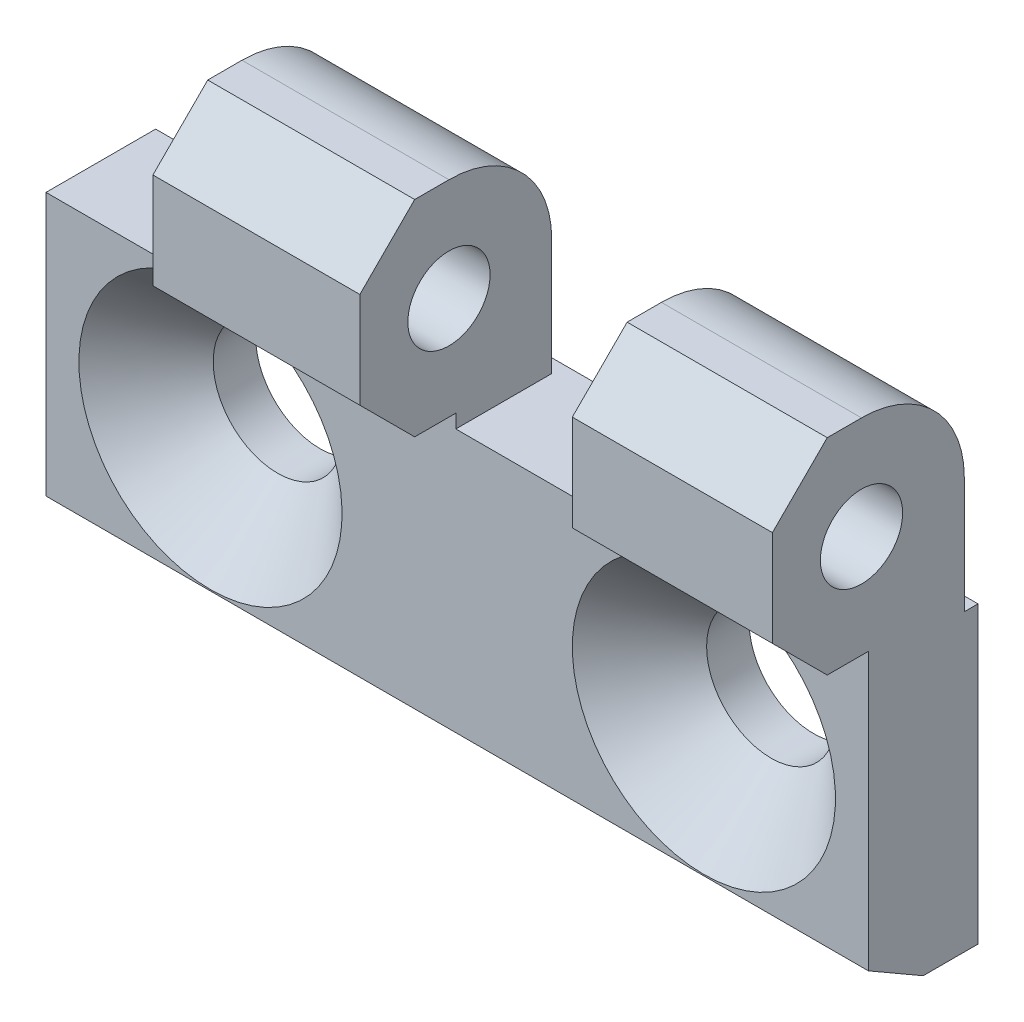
ISO-10303-21;
HEADER;
FILE_DESCRIPTION(('STEP AP214'),'2;1');
FILE_NAME('part.step','',(''),(''),'','','');
FILE_SCHEMA(('AUTOMOTIVE_DESIGN { 1 0 10303 214 1 1 1 1 }'));
ENDSEC;
DATA;
#1=APPLICATION_CONTEXT('core data for automotive mechanical design processes');
#2=APPLICATION_PROTOCOL_DEFINITION('international standard','automotive_design',2000,#1);
#3=PRODUCT_CONTEXT('',#1,'mechanical');
#4=PRODUCT('Part','Part','',(#3));
#5=PRODUCT_RELATED_PRODUCT_CATEGORY('part','',(#4));
#6=PRODUCT_DEFINITION_FORMATION('','',#4);
#7=PRODUCT_DEFINITION_CONTEXT('part definition',#1,'design');
#8=PRODUCT_DEFINITION('design','',#6,#7);
#9=PRODUCT_DEFINITION_SHAPE('','',#8);
#10=(LENGTH_UNIT() NAMED_UNIT(*) SI_UNIT(.MILLI.,.METRE.));
#11=(NAMED_UNIT(*) PLANE_ANGLE_UNIT() SI_UNIT($,.RADIAN.));
#12=(NAMED_UNIT(*) SI_UNIT($,.STERADIAN.) SOLID_ANGLE_UNIT());
#13=UNCERTAINTY_MEASURE_WITH_UNIT(LENGTH_MEASURE(1.E-05),#10,'distance_accuracy_value','');
#14=(GEOMETRIC_REPRESENTATION_CONTEXT(3) GLOBAL_UNCERTAINTY_ASSIGNED_CONTEXT((#13)) GLOBAL_UNIT_ASSIGNED_CONTEXT((#10,
#11,#12)) REPRESENTATION_CONTEXT('',''));
#15=CARTESIAN_POINT('',(0.,0.,0.));
#16=DIRECTION('',(0.,0.,1.));
#17=DIRECTION('',(1.,0.,0.));
#18=AXIS2_PLACEMENT_3D('',#15,#16,#17);
#19=CARTESIAN_POINT('',(-6.,12.75,0.5));
#20=DIRECTION('',(0.,1.,0.));
#21=DIRECTION('',(0.,0.,1.));
#22=AXIS2_PLACEMENT_3D('',#19,#20,#21);
#23=PLANE('',#22);
#24=DIRECTION('',(0.,0.,1.));
#25=VECTOR('',#24,1.);
#26=CARTESIAN_POINT('',(8.95,12.75,0.5));
#27=LINE('',#26,#25);
#28=CARTESIAN_POINT('',(8.95,12.75,5.5));
#29=VERTEX_POINT('',#28);
#30=CARTESIAN_POINT('',(8.95,12.75,4.25));
#31=VERTEX_POINT('',#30);
#32=EDGE_CURVE('E290',#29,#31,#27,.F.);
#33=ORIENTED_EDGE('',*,*,#32,.T.);
#34=DIRECTION('',(-1.,0.,0.));
#35=VECTOR('',#34,1.);
#36=CARTESIAN_POINT('',(24.05658667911,12.75,4.25));
#37=LINE('',#36,#35);
#38=CARTESIAN_POINT('',(1.4,12.75,4.25));
#39=VERTEX_POINT('',#38);
#40=EDGE_CURVE('E287',#39,#31,#37,.F.);
#41=ORIENTED_EDGE('',*,*,#40,.F.);
#42=DIRECTION('',(0.,0.,1.));
#43=VECTOR('',#42,1.);
#44=CARTESIAN_POINT('',(1.4,12.75,0.5));
#45=LINE('',#44,#43);
#46=CARTESIAN_POINT('',(1.4,12.75,5.5));
#47=VERTEX_POINT('',#46);
#48=EDGE_CURVE('E175',#39,#47,#45,.T.);
#49=ORIENTED_EDGE('',*,*,#48,.T.);
#50=DIRECTION('',(1.,0.,0.));
#51=VECTOR('',#50,1.);
#52=CARTESIAN_POINT('',(-6.,12.75,5.5));
#53=LINE('',#52,#51);
#54=EDGE_CURVE('E254',#29,#47,#53,.F.);
#55=ORIENTED_EDGE('',*,*,#54,.F.);
#56=EDGE_LOOP('',(#33,#41,#49,#55));
#57=FACE_BOUND('',#56,.T.);
#58=ADVANCED_FACE('F14',(#57),#23,.T.);
#59=CARTESIAN_POINT('',(24.05658667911,9.,4.25));
#60=DIRECTION('',(-1.,0.,0.));
#61=DIRECTION('',(0.,0.,-1.));
#62=AXIS2_PLACEMENT_3D('',#59,#60,#61);
#63=CYLINDRICAL_SURFACE('',#62,3.75);
#64=CARTESIAN_POINT('',(8.95,9.,4.25));
#65=DIRECTION('',(-1.,0.,0.));
#66=DIRECTION('',(0.,0.,-1.));
#67=AXIS2_PLACEMENT_3D('',#64,#65,#66);
#68=CIRCLE('',#67,3.75);
#69=CARTESIAN_POINT('',(8.95,9.,0.5));
#70=VERTEX_POINT('',#69);
#71=EDGE_CURVE('E185',#31,#70,#68,.T.);
#72=ORIENTED_EDGE('',*,*,#71,.T.);
#73=DIRECTION('',(1.,0.,0.));
#74=VECTOR('',#73,1.);
#75=CARTESIAN_POINT('',(-6.,9.,0.5));
#76=LINE('',#75,#74);
#77=CARTESIAN_POINT('',(1.4,9.,0.5));
#78=VERTEX_POINT('',#77);
#79=EDGE_CURVE('E182',#78,#70,#76,.T.);
#80=ORIENTED_EDGE('',*,*,#79,.F.);
#81=CARTESIAN_POINT('',(1.4,9.,4.25));
#82=DIRECTION('',(-1.,0.,0.));
#83=DIRECTION('',(0.,0.,-1.));
#84=AXIS2_PLACEMENT_3D('',#81,#82,#83);
#85=CIRCLE('',#84,3.75);
#86=EDGE_CURVE('E17',#78,#39,#85,.F.);
#87=ORIENTED_EDGE('',*,*,#86,.T.);
#88=ORIENTED_EDGE('',*,*,#40,.T.);
#89=EDGE_LOOP('',(#72,#80,#87,#88));
#90=FACE_BOUND('',#89,.T.);
#91=ADVANCED_FACE('F183',(#90),#63,.T.);
#92=CARTESIAN_POINT('',(-6.,5.25,5.5));
#93=DIRECTION('',(0.,-0.707106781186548,0.707106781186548));
#94=DIRECTION('',(0.,-0.707106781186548,-0.707106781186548));
#95=AXIS2_PLACEMENT_3D('',#92,#93,#94);
#96=PLANE('',#95);
#97=DIRECTION('',(1.,0.,0.));
#98=VECTOR('',#97,1.);
#99=CARTESIAN_POINT('',(-6.,7.25,7.5));
#100=LINE('',#99,#98);
#101=CARTESIAN_POINT('',(1.4,7.25,7.5));
#102=VERTEX_POINT('',#101);
#103=CARTESIAN_POINT('',(8.95,7.25,7.5));
#104=VERTEX_POINT('',#103);
#105=EDGE_CURVE('E289',#102,#104,#100,.T.);
#106=ORIENTED_EDGE('',*,*,#105,.F.);
#107=DIRECTION('',(0.,-0.707106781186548,-0.707106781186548));
#108=VECTOR('',#107,1.);
#109=CARTESIAN_POINT('',(1.4,7.25,7.5));
#110=LINE('',#109,#108);
#111=CARTESIAN_POINT('',(1.4,5.25,5.5));
#112=VERTEX_POINT('',#111);
#113=EDGE_CURVE('E195',#102,#112,#110,.T.);
#114=ORIENTED_EDGE('',*,*,#113,.T.);
#115=DIRECTION('',(1.,0.,0.));
#116=VECTOR('',#115,1.);
#117=CARTESIAN_POINT('',(-6.,5.25,5.5));
#118=LINE('',#117,#116);
#119=CARTESIAN_POINT('',(8.95,5.25,5.5));
#120=VERTEX_POINT('',#119);
#121=EDGE_CURVE('E180',#120,#112,#118,.F.);
#122=ORIENTED_EDGE('',*,*,#121,.F.);
#123=DIRECTION('',(0.,0.707106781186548,0.707106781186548));
#124=VECTOR('',#123,1.);
#125=CARTESIAN_POINT('',(8.95,5.25,5.5));
#126=LINE('',#125,#124);
#127=EDGE_CURVE('E224',#120,#104,#126,.T.);
#128=ORIENTED_EDGE('',*,*,#127,.T.);
#129=EDGE_LOOP('',(#106,#114,#122,#128));
#130=FACE_BOUND('',#129,.T.);
#131=ADVANCED_FACE('F543',(#130),#96,.T.);
#132=CARTESIAN_POINT('',(-6.,12.75,7.5));
#133=DIRECTION('',(0.,0.,1.));
#134=DIRECTION('',(0.,-1.,0.));
#135=AXIS2_PLACEMENT_3D('',#132,#133,#134);
#136=PLANE('',#135);
#137=DIRECTION('',(1.,0.,0.));
#138=VECTOR('',#137,1.);
#139=CARTESIAN_POINT('',(-6.,10.75,7.5));
#140=LINE('',#139,#138);
#141=CARTESIAN_POINT('',(1.4,10.75,7.5));
#142=VERTEX_POINT('',#141);
#143=CARTESIAN_POINT('',(8.95,10.75,7.5));
#144=VERTEX_POINT('',#143);
#145=EDGE_CURVE('E301',#142,#144,#140,.T.);
#146=ORIENTED_EDGE('',*,*,#145,.F.);
#147=DIRECTION('',(0.,-1.,0.));
#148=VECTOR('',#147,1.);
#149=CARTESIAN_POINT('',(1.4,4.75,7.5));
#150=LINE('',#149,#148);
#151=EDGE_CURVE('E292',#142,#102,#150,.T.);
#152=ORIENTED_EDGE('',*,*,#151,.T.);
#153=ORIENTED_EDGE('',*,*,#105,.T.);
#154=DIRECTION('',(0.,-1.,0.));
#155=VECTOR('',#154,1.);
#156=CARTESIAN_POINT('',(8.95,12.75,7.5));
#157=LINE('',#156,#155);
#158=EDGE_CURVE('E284',#104,#144,#157,.F.);
#159=ORIENTED_EDGE('',*,*,#158,.T.);
#160=EDGE_LOOP('',(#146,#152,#153,#159));
#161=FACE_BOUND('',#160,.T.);
#162=ADVANCED_FACE('F546',(#161),#136,.T.);
#163=CARTESIAN_POINT('',(-6.,10.75,7.5));
#164=DIRECTION('',(0.,0.707106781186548,0.707106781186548));
#165=DIRECTION('',(0.,-0.707106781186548,0.707106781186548));
#166=AXIS2_PLACEMENT_3D('',#163,#164,#165);
#167=PLANE('',#166);
#168=ORIENTED_EDGE('',*,*,#54,.T.);
#169=DIRECTION('',(0.,-0.707106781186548,0.707106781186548));
#170=VECTOR('',#169,1.);
#171=CARTESIAN_POINT('',(1.4,12.75,5.5));
#172=LINE('',#171,#170);
#173=EDGE_CURVE('E179',#47,#142,#172,.T.);
#174=ORIENTED_EDGE('',*,*,#173,.T.);
#175=ORIENTED_EDGE('',*,*,#145,.T.);
#176=DIRECTION('',(0.,0.707106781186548,-0.707106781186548));
#177=VECTOR('',#176,1.);
#178=CARTESIAN_POINT('',(8.95,10.75,7.5));
#179=LINE('',#178,#177);
#180=EDGE_CURVE('E334',#144,#29,#179,.T.);
#181=ORIENTED_EDGE('',*,*,#180,.T.);
#182=EDGE_LOOP('',(#168,#174,#175,#181));
#183=FACE_BOUND('',#182,.T.);
#184=ADVANCED_FACE('F550',(#183),#167,.T.);
#185=CARTESIAN_POINT('',(-6.,12.75,0.5));
#186=DIRECTION('',(0.,1.,0.));
#187=DIRECTION('',(0.,0.,1.));
#188=AXIS2_PLACEMENT_3D('',#185,#186,#187);
#189=PLANE('',#188);
#190=DIRECTION('',(0.,0.,1.));
#191=VECTOR('',#190,1.);
#192=CARTESIAN_POINT('',(24.,12.75,0.5));
#193=LINE('',#192,#191);
#194=CARTESIAN_POINT('',(24.,12.75,5.5));
#195=VERTEX_POINT('',#194);
#196=CARTESIAN_POINT('',(24.,12.75,4.25));
#197=VERTEX_POINT('',#196);
#198=EDGE_CURVE('E243',#195,#197,#193,.F.);
#199=ORIENTED_EDGE('',*,*,#198,.T.);
#200=DIRECTION('',(-1.,0.,0.));
#201=VECTOR('',#200,1.);
#202=CARTESIAN_POINT('',(24.05658667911,12.75,4.25));
#203=LINE('',#202,#201);
#204=CARTESIAN_POINT('',(16.7,12.75,4.25));
#205=VERTEX_POINT('',#204);
#206=EDGE_CURVE('E465',#205,#197,#203,.F.);
#207=ORIENTED_EDGE('',*,*,#206,.F.);
#208=DIRECTION('',(0.,0.,1.));
#209=VECTOR('',#208,1.);
#210=CARTESIAN_POINT('',(16.7,12.75,8.25));
#211=LINE('',#210,#209);
#212=CARTESIAN_POINT('',(16.7,12.75,5.5));
#213=VERTEX_POINT('',#212);
#214=EDGE_CURVE('E231',#205,#213,#211,.T.);
#215=ORIENTED_EDGE('',*,*,#214,.T.);
#216=DIRECTION('',(1.,0.,0.));
#217=VECTOR('',#216,1.);
#218=CARTESIAN_POINT('',(-6.,12.75,5.5));
#219=LINE('',#218,#217);
#220=EDGE_CURVE('E230',#195,#213,#219,.F.);
#221=ORIENTED_EDGE('',*,*,#220,.F.);
#222=EDGE_LOOP('',(#199,#207,#215,#221));
#223=FACE_BOUND('',#222,.T.);
#224=ADVANCED_FACE('F604',(#223),#189,.T.);
#225=CARTESIAN_POINT('',(-6.,5.25,7.5));
#226=DIRECTION('',(0.,-1.,0.));
#227=DIRECTION('',(0.,0.,-1.));
#228=AXIS2_PLACEMENT_3D('',#225,#226,#227);
#229=PLANE('',#228);
#230=DIRECTION('',(1.,0.,0.));
#231=VECTOR('',#230,1.);
#232=CARTESIAN_POINT('',(-6.,5.25,5.5));
#233=LINE('',#232,#231);
#234=CARTESIAN_POINT('',(16.7,5.25,5.5));
#235=VERTEX_POINT('',#234);
#236=CARTESIAN_POINT('',(24.,5.25,5.5));
#237=VERTEX_POINT('',#236);
#238=EDGE_CURVE('E257',#235,#237,#233,.T.);
#239=ORIENTED_EDGE('',*,*,#238,.F.);
#240=DIRECTION('',(0.,0.,1.));
#241=VECTOR('',#240,1.);
#242=CARTESIAN_POINT('',(16.7,5.25,8.25));
#243=LINE('',#242,#241);
#244=CARTESIAN_POINT('',(16.7,5.25,4.));
#245=VERTEX_POINT('',#244);
#246=EDGE_CURVE('E228',#235,#245,#243,.F.);
#247=ORIENTED_EDGE('',*,*,#246,.T.);
#248=DIRECTION('',(1.,0.,0.));
#249=VECTOR('',#248,1.);
#250=CARTESIAN_POINT('',(-6.,5.25,4.));
#251=LINE('',#250,#249);
#252=CARTESIAN_POINT('',(24.,5.25,4.));
#253=VERTEX_POINT('',#252);
#254=EDGE_CURVE('E234',#253,#245,#251,.F.);
#255=ORIENTED_EDGE('',*,*,#254,.F.);
#256=DIRECTION('',(0.,0.,-1.));
#257=VECTOR('',#256,1.);
#258=CARTESIAN_POINT('',(24.,5.25,7.5));
#259=LINE('',#258,#257);
#260=EDGE_CURVE('E241',#253,#237,#259,.F.);
#261=ORIENTED_EDGE('',*,*,#260,.T.);
#262=EDGE_LOOP('',(#239,#247,#255,#261));
#263=FACE_BOUND('',#262,.T.);
#264=ADVANCED_FACE('F601',(#263),#229,.T.);
#265=CARTESIAN_POINT('',(-6.,5.25,7.5));
#266=DIRECTION('',(0.,-1.,0.));
#267=DIRECTION('',(0.,0.,-1.));
#268=AXIS2_PLACEMENT_3D('',#265,#266,#267);
#269=PLANE('',#268);
#270=ORIENTED_EDGE('',*,*,#121,.T.);
#271=DIRECTION('',(0.,0.,1.));
#272=VECTOR('',#271,1.);
#273=CARTESIAN_POINT('',(1.4,5.25,8.25));
#274=LINE('',#273,#272);
#275=CARTESIAN_POINT('',(1.4,5.25,4.));
#276=VERTEX_POINT('',#275);
#277=EDGE_CURVE('E193',#112,#276,#274,.F.);
#278=ORIENTED_EDGE('',*,*,#277,.T.);
#279=DIRECTION('',(1.,0.,0.));
#280=VECTOR('',#279,1.);
#281=CARTESIAN_POINT('',(-6.,5.25,4.));
#282=LINE('',#281,#280);
#283=CARTESIAN_POINT('',(8.95,5.25,4.));
#284=VERTEX_POINT('',#283);
#285=EDGE_CURVE('E211',#284,#276,#282,.F.);
#286=ORIENTED_EDGE('',*,*,#285,.F.);
#287=DIRECTION('',(0.,0.,-1.));
#288=VECTOR('',#287,1.);
#289=CARTESIAN_POINT('',(8.95,5.25,8.25));
#290=LINE('',#289,#288);
#291=EDGE_CURVE('E221',#284,#120,#290,.F.);
#292=ORIENTED_EDGE('',*,*,#291,.T.);
#293=EDGE_LOOP('',(#270,#278,#286,#292));
#294=FACE_BOUND('',#293,.T.);
#295=ADVANCED_FACE('F540',(#294),#269,.T.);
#296=CARTESIAN_POINT('',(1.4,4.75,8.25));
#297=DIRECTION('',(1.,0.,0.));
#298=DIRECTION('',(0.,0.,1.));
#299=AXIS2_PLACEMENT_3D('',#296,#297,#298);
#300=PLANE('',#299);
#301=DIRECTION('',(0.,0.,1.));
#302=VECTOR('',#301,1.);
#303=CARTESIAN_POINT('',(1.4,4.75,0.));
#304=LINE('',#303,#302);
#305=CARTESIAN_POINT('',(1.4,4.75,4.));
#306=VERTEX_POINT('',#305);
#307=CARTESIAN_POINT('',(1.4,4.75,0.5));
#308=VERTEX_POINT('',#307);
#309=EDGE_CURVE('E203',#306,#308,#304,.F.);
#310=ORIENTED_EDGE('',*,*,#309,.F.);
#311=DIRECTION('',(0.,-1.,0.));
#312=VECTOR('',#311,1.);
#313=CARTESIAN_POINT('',(1.4,5.25,4.));
#314=LINE('',#313,#312);
#315=EDGE_CURVE('E208',#276,#306,#314,.T.);
#316=ORIENTED_EDGE('',*,*,#315,.F.);
#317=ORIENTED_EDGE('',*,*,#277,.F.);
#318=ORIENTED_EDGE('',*,*,#113,.F.);
#319=ORIENTED_EDGE('',*,*,#151,.F.);
#320=ORIENTED_EDGE('',*,*,#173,.F.);
#321=ORIENTED_EDGE('',*,*,#48,.F.);
#322=ORIENTED_EDGE('',*,*,#86,.F.);
#323=DIRECTION('',(0.,1.,0.));
#324=VECTOR('',#323,1.);
#325=CARTESIAN_POINT('',(1.4,4.75,0.5));
#326=LINE('',#325,#324);
#327=EDGE_CURVE('E172',#308,#78,#326,.T.);
#328=ORIENTED_EDGE('',*,*,#327,.F.);
#329=EDGE_LOOP('',(#310,#316,#317,#318,#319,#320,#321,#322,#328));
#330=FACE_BOUND('',#329,.T.);
#331=CARTESIAN_POINT('',(1.4,9.,4.25));
#332=DIRECTION('',(-1.,0.,0.));
#333=DIRECTION('',(0.,0.,-1.));
#334=AXIS2_PLACEMENT_3D('',#331,#332,#333);
#335=CIRCLE('',#334,1.5);
#336=CARTESIAN_POINT('',(1.4,9.,2.75));
#337=VERTEX_POINT('',#336);
#338=EDGE_CURVE('E835',#337,#337,#335,.T.);
#339=ORIENTED_EDGE('',*,*,#338,.F.);
#340=EDGE_LOOP('',(#339));
#341=FACE_BOUND('',#340,.T.);
#342=ADVANCED_FACE('F169',(#330,#341),#300,.F.);
#343=CARTESIAN_POINT('',(-6.,4.75,0.5));
#344=DIRECTION('',(0.,0.,-1.));
#345=DIRECTION('',(0.,1.,0.));
#346=AXIS2_PLACEMENT_3D('',#343,#344,#345);
#347=PLANE('',#346);
#348=ORIENTED_EDGE('',*,*,#327,.T.);
#349=ORIENTED_EDGE('',*,*,#79,.T.);
#350=DIRECTION('',(0.,-1.,0.));
#351=VECTOR('',#350,1.);
#352=CARTESIAN_POINT('',(8.95,12.75,0.5));
#353=LINE('',#352,#351);
#354=CARTESIAN_POINT('',(8.95,4.75,0.5));
#355=VERTEX_POINT('',#354);
#356=EDGE_CURVE('E225',#70,#355,#353,.T.);
#357=ORIENTED_EDGE('',*,*,#356,.T.);
#358=DIRECTION('',(1.,0.,0.));
#359=VECTOR('',#358,1.);
#360=CARTESIAN_POINT('',(-6.,4.75,0.5));
#361=LINE('',#360,#359);
#362=EDGE_CURVE('E191',#308,#355,#361,.T.);
#363=ORIENTED_EDGE('',*,*,#362,.F.);
#364=EDGE_LOOP('',(#348,#349,#357,#363));
#365=FACE_BOUND('',#364,.T.);
#366=ADVANCED_FACE('F189',(#365),#347,.T.);
#367=CARTESIAN_POINT('',(8.95,12.75,8.25));
#368=DIRECTION('',(-1.,0.,0.));
#369=DIRECTION('',(0.,0.,-1.));
#370=AXIS2_PLACEMENT_3D('',#367,#368,#369);
#371=PLANE('',#370);
#372=ORIENTED_EDGE('',*,*,#180,.F.);
#373=ORIENTED_EDGE('',*,*,#158,.F.);
#374=ORIENTED_EDGE('',*,*,#127,.F.);
#375=ORIENTED_EDGE('',*,*,#291,.F.);
#376=DIRECTION('',(0.,-1.,0.));
#377=VECTOR('',#376,1.);
#378=CARTESIAN_POINT('',(8.95,5.25,4.));
#379=LINE('',#378,#377);
#380=CARTESIAN_POINT('',(8.95,4.75,4.));
#381=VERTEX_POINT('',#380);
#382=EDGE_CURVE('E218',#381,#284,#379,.F.);
#383=ORIENTED_EDGE('',*,*,#382,.F.);
#384=DIRECTION('',(0.,0.,1.));
#385=VECTOR('',#384,1.);
#386=CARTESIAN_POINT('',(8.95,4.75,0.));
#387=LINE('',#386,#385);
#388=EDGE_CURVE('E514',#355,#381,#387,.T.);
#389=ORIENTED_EDGE('',*,*,#388,.F.);
#390=ORIENTED_EDGE('',*,*,#356,.F.);
#391=ORIENTED_EDGE('',*,*,#71,.F.);
#392=ORIENTED_EDGE('',*,*,#32,.F.);
#393=EDGE_LOOP('',(#372,#373,#374,#375,#383,#389,#390,#391,#392));
#394=FACE_BOUND('',#393,.T.);
#395=CARTESIAN_POINT('',(8.95,9.,4.25));
#396=DIRECTION('',(-1.,0.,0.));
#397=DIRECTION('',(0.,0.,-1.));
#398=AXIS2_PLACEMENT_3D('',#395,#396,#397);
#399=CIRCLE('',#398,1.5);
#400=CARTESIAN_POINT('',(8.95,9.,2.75));
#401=VERTEX_POINT('',#400);
#402=EDGE_CURVE('E832',#401,#401,#399,.F.);
#403=ORIENTED_EDGE('',*,*,#402,.F.);
#404=EDGE_LOOP('',(#403));
#405=FACE_BOUND('',#404,.T.);
#406=ADVANCED_FACE('F554',(#394,#405),#371,.F.);
#407=CARTESIAN_POINT('',(16.7,4.75,8.25));
#408=DIRECTION('',(1.,0.,0.));
#409=DIRECTION('',(0.,0.,1.));
#410=AXIS2_PLACEMENT_3D('',#407,#408,#409);
#411=PLANE('',#410);
#412=DIRECTION('',(0.,0.,1.));
#413=VECTOR('',#412,1.);
#414=CARTESIAN_POINT('',(16.7,4.75,0.));
#415=LINE('',#414,#413);
#416=CARTESIAN_POINT('',(16.7,4.75,4.));
#417=VERTEX_POINT('',#416);
#418=CARTESIAN_POINT('',(16.7,4.75,0.5));
#419=VERTEX_POINT('',#418);
#420=EDGE_CURVE('E476',#417,#419,#415,.F.);
#421=ORIENTED_EDGE('',*,*,#420,.F.);
#422=DIRECTION('',(0.,-1.,0.));
#423=VECTOR('',#422,1.);
#424=CARTESIAN_POINT('',(16.7,5.25,4.));
#425=LINE('',#424,#423);
#426=EDGE_CURVE('E237',#245,#417,#425,.T.);
#427=ORIENTED_EDGE('',*,*,#426,.F.);
#428=ORIENTED_EDGE('',*,*,#246,.F.);
#429=DIRECTION('',(0.,-0.707106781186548,-0.707106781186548));
#430=VECTOR('',#429,1.);
#431=CARTESIAN_POINT('',(16.7,5.25,5.5));
#432=LINE('',#431,#430);
#433=CARTESIAN_POINT('',(16.7,7.25,7.5));
#434=VERTEX_POINT('',#433);
#435=EDGE_CURVE('E264',#434,#235,#432,.T.);
#436=ORIENTED_EDGE('',*,*,#435,.F.);
#437=DIRECTION('',(0.,-1.,0.));
#438=VECTOR('',#437,1.);
#439=CARTESIAN_POINT('',(16.7,12.75,7.5));
#440=LINE('',#439,#438);
#441=CARTESIAN_POINT('',(16.7,10.75,7.5));
#442=VERTEX_POINT('',#441);
#443=EDGE_CURVE('E261',#442,#434,#440,.T.);
#444=ORIENTED_EDGE('',*,*,#443,.F.);
#445=DIRECTION('',(0.,-0.707106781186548,0.707106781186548));
#446=VECTOR('',#445,1.);
#447=CARTESIAN_POINT('',(16.7,10.75,7.5));
#448=LINE('',#447,#446);
#449=EDGE_CURVE('E270',#213,#442,#448,.T.);
#450=ORIENTED_EDGE('',*,*,#449,.F.);
#451=ORIENTED_EDGE('',*,*,#214,.F.);
#452=CARTESIAN_POINT('',(16.7,9.,4.25));
#453=DIRECTION('',(-1.,0.,0.));
#454=DIRECTION('',(0.,0.,-1.));
#455=AXIS2_PLACEMENT_3D('',#452,#453,#454);
#456=CIRCLE('',#455,3.75);
#457=CARTESIAN_POINT('',(16.7,9.,0.5));
#458=VERTEX_POINT('',#457);
#459=EDGE_CURVE('E468',#458,#205,#456,.F.);
#460=ORIENTED_EDGE('',*,*,#459,.F.);
#461=DIRECTION('',(0.,1.,0.));
#462=VECTOR('',#461,1.);
#463=CARTESIAN_POINT('',(16.7,4.75,0.5));
#464=LINE('',#463,#462);
#465=EDGE_CURVE('E267',#419,#458,#464,.T.);
#466=ORIENTED_EDGE('',*,*,#465,.F.);
#467=EDGE_LOOP('',(#421,#427,#428,#436,#444,#450,#451,#460,#466));
#468=FACE_BOUND('',#467,.T.);
#469=CARTESIAN_POINT('',(16.7,9.,4.25));
#470=DIRECTION('',(-1.,0.,0.));
#471=DIRECTION('',(0.,0.,-1.));
#472=AXIS2_PLACEMENT_3D('',#469,#470,#471);
#473=CIRCLE('',#472,1.5);
#474=CARTESIAN_POINT('',(16.7,9.,2.75));
#475=VERTEX_POINT('',#474);
#476=EDGE_CURVE('E837',#475,#475,#473,.T.);
#477=ORIENTED_EDGE('',*,*,#476,.F.);
#478=EDGE_LOOP('',(#477));
#479=FACE_BOUND('',#478,.T.);
#480=ADVANCED_FACE('F588',(#468,#479),#411,.F.);
#481=CARTESIAN_POINT('',(-6.,10.75,7.5));
#482=DIRECTION('',(0.,0.707106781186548,0.707106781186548));
#483=DIRECTION('',(0.,-0.707106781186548,0.707106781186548));
#484=AXIS2_PLACEMENT_3D('',#481,#482,#483);
#485=PLANE('',#484);
#486=ORIENTED_EDGE('',*,*,#220,.T.);
#487=ORIENTED_EDGE('',*,*,#449,.T.);
#488=DIRECTION('',(1.,0.,0.));
#489=VECTOR('',#488,1.);
#490=CARTESIAN_POINT('',(-6.,10.75,7.5));
#491=LINE('',#490,#489);
#492=CARTESIAN_POINT('',(24.,10.75,7.5));
#493=VERTEX_POINT('',#492);
#494=EDGE_CURVE('E272',#493,#442,#491,.F.);
#495=ORIENTED_EDGE('',*,*,#494,.F.);
#496=DIRECTION('',(0.,-0.707106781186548,0.707106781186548));
#497=VECTOR('',#496,1.);
#498=CARTESIAN_POINT('',(24.,12.75,5.5));
#499=LINE('',#498,#497);
#500=EDGE_CURVE('E321',#195,#493,#499,.T.);
#501=ORIENTED_EDGE('',*,*,#500,.F.);
#502=EDGE_LOOP('',(#486,#487,#495,#501));
#503=FACE_BOUND('',#502,.T.);
#504=ADVANCED_FACE('F584',(#503),#485,.T.);
#505=CARTESIAN_POINT('',(-6.,12.75,7.5));
#506=DIRECTION('',(0.,0.,1.));
#507=DIRECTION('',(0.,-1.,0.));
#508=AXIS2_PLACEMENT_3D('',#505,#506,#507);
#509=PLANE('',#508);
#510=ORIENTED_EDGE('',*,*,#494,.T.);
#511=ORIENTED_EDGE('',*,*,#443,.T.);
#512=DIRECTION('',(1.,0.,0.));
#513=VECTOR('',#512,1.);
#514=CARTESIAN_POINT('',(-6.,7.25,7.5));
#515=LINE('',#514,#513);
#516=CARTESIAN_POINT('',(24.,7.25,7.5));
#517=VERTEX_POINT('',#516);
#518=EDGE_CURVE('E260',#517,#434,#515,.F.);
#519=ORIENTED_EDGE('',*,*,#518,.F.);
#520=DIRECTION('',(0.,-1.,0.));
#521=VECTOR('',#520,1.);
#522=CARTESIAN_POINT('',(24.,9.,7.5));
#523=LINE('',#522,#521);
#524=EDGE_CURVE('E318',#493,#517,#523,.T.);
#525=ORIENTED_EDGE('',*,*,#524,.F.);
#526=EDGE_LOOP('',(#510,#511,#519,#525));
#527=FACE_BOUND('',#526,.T.);
#528=ADVANCED_FACE('F580',(#527),#509,.T.);
#529=CARTESIAN_POINT('',(-6.,5.25,5.5));
#530=DIRECTION('',(0.,-0.707106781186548,0.707106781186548));
#531=DIRECTION('',(0.,-0.707106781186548,-0.707106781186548));
#532=AXIS2_PLACEMENT_3D('',#529,#530,#531);
#533=PLANE('',#532);
#534=ORIENTED_EDGE('',*,*,#518,.T.);
#535=ORIENTED_EDGE('',*,*,#435,.T.);
#536=ORIENTED_EDGE('',*,*,#238,.T.);
#537=DIRECTION('',(0.,-0.707106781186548,-0.707106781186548));
#538=VECTOR('',#537,1.);
#539=CARTESIAN_POINT('',(24.,7.25,7.5));
#540=LINE('',#539,#538);
#541=EDGE_CURVE('E250',#517,#237,#540,.T.);
#542=ORIENTED_EDGE('',*,*,#541,.F.);
#543=EDGE_LOOP('',(#534,#535,#536,#542));
#544=FACE_BOUND('',#543,.T.);
#545=ADVANCED_FACE('F576',(#544),#533,.T.);
#546=CARTESIAN_POINT('',(-6.,4.75,0.5));
#547=DIRECTION('',(0.,0.,-1.));
#548=DIRECTION('',(0.,1.,0.));
#549=AXIS2_PLACEMENT_3D('',#546,#547,#548);
#550=PLANE('',#549);
#551=ORIENTED_EDGE('',*,*,#465,.T.);
#552=DIRECTION('',(-1.,0.,0.));
#553=VECTOR('',#552,1.);
#554=CARTESIAN_POINT('',(24.05658667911,9.,0.5));
#555=LINE('',#554,#553);
#556=CARTESIAN_POINT('',(24.,9.,0.5));
#557=VERTEX_POINT('',#556);
#558=EDGE_CURVE('E238',#557,#458,#555,.T.);
#559=ORIENTED_EDGE('',*,*,#558,.F.);
#560=DIRECTION('',(0.,-1.,0.));
#561=VECTOR('',#560,1.);
#562=CARTESIAN_POINT('',(24.,9.,0.5));
#563=LINE('',#562,#561);
#564=CARTESIAN_POINT('',(24.,4.75,0.5));
#565=VERTEX_POINT('',#564);
#566=EDGE_CURVE('E349',#565,#557,#563,.F.);
#567=ORIENTED_EDGE('',*,*,#566,.F.);
#568=DIRECTION('',(1.,0.,0.));
#569=VECTOR('',#568,1.);
#570=CARTESIAN_POINT('',(-6.,4.75,0.5));
#571=LINE('',#570,#569);
#572=EDGE_CURVE('E453',#419,#565,#571,.T.);
#573=ORIENTED_EDGE('',*,*,#572,.F.);
#574=EDGE_LOOP('',(#551,#559,#567,#573));
#575=FACE_BOUND('',#574,.T.);
#576=ADVANCED_FACE('F570',(#575),#550,.T.);
#577=CARTESIAN_POINT('',(24.05658667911,9.,4.25));
#578=DIRECTION('',(-1.,0.,0.));
#579=DIRECTION('',(0.,0.,-1.));
#580=AXIS2_PLACEMENT_3D('',#577,#578,#579);
#581=CYLINDRICAL_SURFACE('',#580,3.75);
#582=CARTESIAN_POINT('',(24.,9.,4.25));
#583=DIRECTION('',(-1.,0.,0.));
#584=DIRECTION('',(0.,0.,-1.));
#585=AXIS2_PLACEMENT_3D('',#582,#583,#584);
#586=CIRCLE('',#585,3.75);
#587=EDGE_CURVE('E345',#557,#197,#586,.F.);
#588=ORIENTED_EDGE('',*,*,#587,.F.);
#589=ORIENTED_EDGE('',*,*,#558,.T.);
#590=ORIENTED_EDGE('',*,*,#459,.T.);
#591=ORIENTED_EDGE('',*,*,#206,.T.);
#592=EDGE_LOOP('',(#588,#589,#590,#591));
#593=FACE_BOUND('',#592,.T.);
#594=ADVANCED_FACE('F563',(#593),#581,.T.);
#595=CARTESIAN_POINT('',(-6.,5.25,4.));
#596=DIRECTION('',(0.,0.,1.));
#597=DIRECTION('',(0.,-1.,0.));
#598=AXIS2_PLACEMENT_3D('',#595,#596,#597);
#599=PLANE('',#598);
#600=CARTESIAN_POINT('',(18.,0.,4.00000000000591));
#601=DIRECTION('',(0.,0.,1.));
#602=DIRECTION('',(0.,-1.,0.));
#603=AXIS2_PLACEMENT_3D('',#600,#601,#602);
#604=CIRCLE('',#603,4.80000000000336);
#605=CARTESIAN_POINT('',(18.,-4.80000000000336,4.00000000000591));
#606=VERTEX_POINT('',#605);
#607=EDGE_CURVE('E359',#606,#606,#604,.F.);
#608=ORIENTED_EDGE('',*,*,#607,.T.);
#609=EDGE_LOOP('',(#608));
#610=FACE_BOUND('',#609,.T.);
#611=DIRECTION('',(1.,0.,0.));
#612=VECTOR('',#611,1.);
#613=CARTESIAN_POINT('',(-6.,4.75,4.));
#614=LINE('',#613,#612);
#615=CARTESIAN_POINT('',(0.691013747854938,4.75,4.00000000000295));
#616=VERTEX_POINT('',#615);
#617=EDGE_CURVE('E205',#616,#306,#614,.T.);
#618=ORIENTED_EDGE('',*,*,#617,.F.);
#619=CARTESIAN_POINT('',(0.,0.,4.00000000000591));
#620=DIRECTION('',(0.,0.,1.));
#621=DIRECTION('',(0.,-1.,0.));
#622=AXIS2_PLACEMENT_3D('',#619,#620,#621);
#623=CIRCLE('',#622,4.79999999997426);
#624=CARTESIAN_POINT('',(-0.691013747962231,4.75,4.0000000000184));
#625=VERTEX_POINT('',#624);
#626=EDGE_CURVE('E464',#616,#625,#623,.F.);
#627=ORIENTED_EDGE('',*,*,#626,.T.);
#628=DIRECTION('',(1.,0.,0.));
#629=VECTOR('',#628,1.);
#630=CARTESIAN_POINT('',(-6.,4.75,4.));
#631=LINE('',#630,#629);
#632=CARTESIAN_POINT('',(-6.,4.75,4.));
#633=VERTEX_POINT('',#632);
#634=EDGE_CURVE('E358',#633,#625,#631,.T.);
#635=ORIENTED_EDGE('',*,*,#634,.F.);
#636=DIRECTION('',(0.,-1.,0.));
#637=VECTOR('',#636,1.);
#638=CARTESIAN_POINT('',(-6.,9.,4.));
#639=LINE('',#638,#637);
#640=CARTESIAN_POINT('',(-6.,-4.84529946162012,4.00000000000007));
#641=VERTEX_POINT('',#640);
#642=EDGE_CURVE('E436',#633,#641,#639,.T.);
#643=ORIENTED_EDGE('',*,*,#642,.T.);
#644=DIRECTION('',(1.,0.,0.));
#645=VECTOR('',#644,1.);
#646=CARTESIAN_POINT('',(-6.,-4.84529946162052,4.0000000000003));
#647=LINE('',#646,#645);
#648=CARTESIAN_POINT('',(24.,-4.84529946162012,4.00000000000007));
#649=VERTEX_POINT('',#648);
#650=EDGE_CURVE('E210',#649,#641,#647,.F.);
#651=ORIENTED_EDGE('',*,*,#650,.F.);
#652=DIRECTION('',(0.,-1.,0.));
#653=VECTOR('',#652,1.);
#654=CARTESIAN_POINT('',(24.,9.,4.));
#655=LINE('',#654,#653);
#656=EDGE_CURVE('E246',#253,#649,#655,.T.);
#657=ORIENTED_EDGE('',*,*,#656,.F.);
#658=ORIENTED_EDGE('',*,*,#254,.T.);
#659=ORIENTED_EDGE('',*,*,#426,.T.);
#660=DIRECTION('',(1.,0.,0.));
#661=VECTOR('',#660,1.);
#662=CARTESIAN_POINT('',(-6.,4.75,4.));
#663=LINE('',#662,#661);
#664=EDGE_CURVE('E506',#381,#417,#663,.T.);
#665=ORIENTED_EDGE('',*,*,#664,.F.);
#666=ORIENTED_EDGE('',*,*,#382,.T.);
#667=ORIENTED_EDGE('',*,*,#285,.T.);
#668=ORIENTED_EDGE('',*,*,#315,.T.);
#669=EDGE_LOOP('',(#618,#627,#635,#643,#651,#657,#658,#659,#665,#666,#667,#668));
#670=FACE_BOUND('',#669,.T.);
#671=ADVANCED_FACE('F537',(#610,#670),#599,.T.);
#672=CARTESIAN_POINT('',(-6.,-6.,2.));
#673=DIRECTION('',(0.,-0.866025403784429,0.500000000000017));
#674=DIRECTION('',(0.,-0.500000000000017,-0.866025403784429));
#675=AXIS2_PLACEMENT_3D('',#672,#673,#674);
#676=PLANE('',#675);
#677=DIRECTION('',(0.,-0.500000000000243,-0.866025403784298));
#678=VECTOR('',#677,1.);
#679=CARTESIAN_POINT('',(-6.,-4.84529946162,4.));
#680=LINE('',#679,#678);
#681=CARTESIAN_POINT('',(-6.,-6.,2.));
#682=VERTEX_POINT('',#681);
#683=EDGE_CURVE('E427',#641,#682,#680,.T.);
#684=ORIENTED_EDGE('',*,*,#683,.T.);
#685=DIRECTION('',(1.,0.,0.));
#686=VECTOR('',#685,1.);
#687=CARTESIAN_POINT('',(-6.,-6.,2.));
#688=LINE('',#687,#686);
#689=CARTESIAN_POINT('',(24.,-6.,2.));
#690=VERTEX_POINT('',#689);
#691=EDGE_CURVE('E420',#690,#682,#688,.F.);
#692=ORIENTED_EDGE('',*,*,#691,.F.);
#693=DIRECTION('',(0.,-0.500000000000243,-0.866025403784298));
#694=VECTOR('',#693,1.);
#695=CARTESIAN_POINT('',(24.,-4.84529946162,4.));
#696=LINE('',#695,#694);
#697=EDGE_CURVE('E249',#649,#690,#696,.T.);
#698=ORIENTED_EDGE('',*,*,#697,.F.);
#699=ORIENTED_EDGE('',*,*,#650,.T.);
#700=EDGE_LOOP('',(#684,#692,#698,#699));
#701=FACE_BOUND('',#700,.T.);
#702=ADVANCED_FACE('F380',(#701),#676,.T.);
#703=CARTESIAN_POINT('',(0.,0.,3.99999999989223));
#704=DIRECTION('',(0.,0.,1.));
#705=DIRECTION('',(0.,-1.,0.));
#706=AXIS2_PLACEMENT_3D('',#703,#704,#705);
#707=CONICAL_SURFACE('',#706,4.79999999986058,0.785398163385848);
#708=CARTESIAN_POINT('',(0.,0.,1.55));
#709=DIRECTION('',(0.,0.,1.));
#710=DIRECTION('',(0.,-1.,0.));
#711=AXIS2_PLACEMENT_3D('',#708,#709,#710);
#712=CIRCLE('',#711,2.35);
#713=CARTESIAN_POINT('',(0.,-2.35,1.55));
#714=VERTEX_POINT('',#713);
#715=EDGE_CURVE('E431',#714,#714,#712,.F.);
#716=ORIENTED_EDGE('',*,*,#715,.T.);
#717=EDGE_LOOP('',(#716));
#718=FACE_BOUND('',#717,.T.);
#719=ORIENTED_EDGE('',*,*,#626,.F.);
#720=CARTESIAN_POINT('',(-0.691013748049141,4.7500000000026,4.00000000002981));
#721=CARTESIAN_POINT('',(-0.576343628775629,4.75000000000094,3.98344263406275));
#722=CARTESIAN_POINT('',(-0.461073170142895,4.75000000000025,3.97092059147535));
#723=CARTESIAN_POINT('',(-0.230533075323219,4.74999999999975,3.95422075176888));
#724=CARTESIAN_POINT('',(-0.115266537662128,4.74999999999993,3.95000000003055));
#725=CARTESIAN_POINT('',(0.115266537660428,4.75000000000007,3.95000000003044));
#726=CARTESIAN_POINT('',(0.230533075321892,4.75000000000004,3.95422075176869));
#727=CARTESIAN_POINT('',(0.461073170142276,4.74999999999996,3.97092059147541));
#728=CARTESIAN_POINT('',(0.576343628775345,4.74999999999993,3.98344263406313));
#729=CARTESIAN_POINT('',(0.691013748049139,4.75,4.00000000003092));
#730=B_SPLINE_CURVE_WITH_KNOTS('',3,(#720,#721,#722,#723,#724,#725,#726,#727,#728,#729),
.UNSPECIFIED.,.F.,.F.,(4,2,2,2,4),(0.,0.347534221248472,0.693265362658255,1.03899650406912,
1.38653072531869),.UNSPECIFIED.);
#731=EDGE_CURVE('E324',#625,#616,#730,.T.);
#732=ORIENTED_EDGE('',*,*,#731,.F.);
#733=EDGE_LOOP('',(#719,#732));
#734=FACE_BOUND('',#733,.T.);
#735=ADVANCED_FACE('F361',(#718,#734),#707,.F.);
#736=CARTESIAN_POINT('',(18.,0.,3.99999999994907));
#737=DIRECTION('',(0.,0.,1.));
#738=DIRECTION('',(0.,-1.,0.));
#739=AXIS2_PLACEMENT_3D('',#736,#737,#738);
#740=CONICAL_SURFACE('',#739,4.79999999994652,0.785398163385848);
#741=CARTESIAN_POINT('',(18.,0.,1.55));
#742=DIRECTION('',(0.,0.,-1.));
#743=DIRECTION('',(0.,1.,0.));
#744=AXIS2_PLACEMENT_3D('',#741,#742,#743);
#745=CIRCLE('',#744,2.35);
#746=CARTESIAN_POINT('',(18.,2.35,1.55));
#747=VERTEX_POINT('',#746);
#748=EDGE_CURVE('E434',#747,#747,#745,.T.);
#749=ORIENTED_EDGE('',*,*,#748,.T.);
#750=EDGE_LOOP('',(#749));
#751=FACE_BOUND('',#750,.T.);
#752=ORIENTED_EDGE('',*,*,#607,.F.);
#753=EDGE_LOOP('',(#752));
#754=FACE_BOUND('',#753,.T.);
#755=ADVANCED_FACE('F370',(#751,#754),#740,.F.);
#756=CARTESIAN_POINT('',(-6.,4.75,0.));
#757=DIRECTION('',(0.,1.,0.));
#758=DIRECTION('',(0.,0.,1.));
#759=AXIS2_PLACEMENT_3D('',#756,#757,#758);
#760=PLANE('',#759);
#761=ORIENTED_EDGE('',*,*,#634,.T.);
#762=ORIENTED_EDGE('',*,*,#731,.T.);
#763=ORIENTED_EDGE('',*,*,#617,.T.);
#764=ORIENTED_EDGE('',*,*,#309,.T.);
#765=ORIENTED_EDGE('',*,*,#362,.T.);
#766=ORIENTED_EDGE('',*,*,#388,.T.);
#767=ORIENTED_EDGE('',*,*,#664,.T.);
#768=ORIENTED_EDGE('',*,*,#420,.T.);
#769=ORIENTED_EDGE('',*,*,#572,.T.);
#770=DIRECTION('',(0.,0.,1.));
#771=VECTOR('',#770,1.);
#772=CARTESIAN_POINT('',(24.,4.75,4.25));
#773=LINE('',#772,#771);
#774=CARTESIAN_POINT('',(24.,4.75,0.));
#775=VERTEX_POINT('',#774);
#776=EDGE_CURVE('E445',#775,#565,#773,.T.);
#777=ORIENTED_EDGE('',*,*,#776,.F.);
#778=DIRECTION('',(1.,0.,0.));
#779=VECTOR('',#778,1.);
#780=CARTESIAN_POINT('',(-6.,4.75,0.));
#781=LINE('',#780,#779);
#782=CARTESIAN_POINT('',(-6.,4.75,0.));
#783=VERTEX_POINT('',#782);
#784=EDGE_CURVE('E460',#783,#775,#781,.T.);
#785=ORIENTED_EDGE('',*,*,#784,.F.);
#786=DIRECTION('',(0.,0.,1.));
#787=VECTOR('',#786,1.);
#788=CARTESIAN_POINT('',(-6.,4.75,4.25));
#789=LINE('',#788,#787);
#790=EDGE_CURVE('E423',#783,#633,#789,.T.);
#791=ORIENTED_EDGE('',*,*,#790,.T.);
#792=EDGE_LOOP('',(#761,#762,#763,#764,#765,#766,#767,#768,#769,#777,#785,#791));
#793=FACE_BOUND('',#792,.T.);
#794=ADVANCED_FACE('F365',(#793),#760,.T.);
#795=CARTESIAN_POINT('',(24.,9.,4.25));
#796=DIRECTION('',(1.,0.,0.));
#797=DIRECTION('',(0.,0.,1.));
#798=AXIS2_PLACEMENT_3D('',#795,#796,#797);
#799=PLANE('',#798);
#800=ORIENTED_EDGE('',*,*,#566,.T.);
#801=ORIENTED_EDGE('',*,*,#587,.T.);
#802=ORIENTED_EDGE('',*,*,#198,.F.);
#803=ORIENTED_EDGE('',*,*,#500,.T.);
#804=ORIENTED_EDGE('',*,*,#524,.T.);
#805=ORIENTED_EDGE('',*,*,#541,.T.);
#806=ORIENTED_EDGE('',*,*,#260,.F.);
#807=ORIENTED_EDGE('',*,*,#656,.T.);
#808=ORIENTED_EDGE('',*,*,#697,.T.);
#809=DIRECTION('',(0.,0.,-1.));
#810=VECTOR('',#809,1.);
#811=CARTESIAN_POINT('',(24.,-6.,4.));
#812=LINE('',#811,#810);
#813=CARTESIAN_POINT('',(24.,-6.,0.));
#814=VERTEX_POINT('',#813);
#815=EDGE_CURVE('E348',#814,#690,#812,.F.);
#816=ORIENTED_EDGE('',*,*,#815,.F.);
#817=DIRECTION('',(0.,1.,0.));
#818=VECTOR('',#817,1.);
#819=CARTESIAN_POINT('',(24.,-6.,0.));
#820=LINE('',#819,#818);
#821=EDGE_CURVE('E479',#775,#814,#820,.F.);
#822=ORIENTED_EDGE('',*,*,#821,.F.);
#823=ORIENTED_EDGE('',*,*,#776,.T.);
#824=EDGE_LOOP('',(#800,#801,#802,#803,#804,#805,#806,#807,#808,#816,#822,#823));
#825=FACE_BOUND('',#824,.T.);
#826=CARTESIAN_POINT('',(24.,9.,4.25));
#827=DIRECTION('',(1.,0.,0.));
#828=DIRECTION('',(0.,0.,1.));
#829=AXIS2_PLACEMENT_3D('',#826,#827,#828);
#830=CIRCLE('',#829,1.5);
#831=CARTESIAN_POINT('',(24.,9.,5.75));
#832=VERTEX_POINT('',#831);
#833=EDGE_CURVE('E328',#832,#832,#830,.F.);
#834=ORIENTED_EDGE('',*,*,#833,.T.);
#835=EDGE_LOOP('',(#834));
#836=FACE_BOUND('',#835,.T.);
#837=ADVANCED_FACE('F369',(#825,#836),#799,.T.);
#838=CARTESIAN_POINT('',(-6.,-6.,4.));
#839=DIRECTION('',(0.,-1.,0.));
#840=DIRECTION('',(0.,0.,-1.));
#841=AXIS2_PLACEMENT_3D('',#838,#839,#840);
#842=PLANE('',#841);
#843=ORIENTED_EDGE('',*,*,#691,.T.);
#844=DIRECTION('',(0.,0.,1.));
#845=VECTOR('',#844,1.);
#846=CARTESIAN_POINT('',(-6.,-6.,4.25));
#847=LINE('',#846,#845);
#848=CARTESIAN_POINT('',(-6.,-6.,0.));
#849=VERTEX_POINT('',#848);
#850=EDGE_CURVE('E32',#682,#849,#847,.F.);
#851=ORIENTED_EDGE('',*,*,#850,.T.);
#852=DIRECTION('',(1.,0.,0.));
#853=VECTOR('',#852,1.);
#854=CARTESIAN_POINT('',(-6.,-6.,0.));
#855=LINE('',#854,#853);
#856=EDGE_CURVE('E439',#814,#849,#855,.F.);
#857=ORIENTED_EDGE('',*,*,#856,.F.);
#858=ORIENTED_EDGE('',*,*,#815,.T.);
#859=EDGE_LOOP('',(#843,#851,#857,#858));
#860=FACE_BOUND('',#859,.T.);
#861=ADVANCED_FACE('F410',(#860),#842,.T.);
#862=CARTESIAN_POINT('',(-6.,9.,4.25));
#863=DIRECTION('',(1.,0.,0.));
#864=DIRECTION('',(0.,0.,1.));
#865=AXIS2_PLACEMENT_3D('',#862,#863,#864);
#866=PLANE('',#865);
#867=ORIENTED_EDGE('',*,*,#850,.F.);
#868=ORIENTED_EDGE('',*,*,#683,.F.);
#869=ORIENTED_EDGE('',*,*,#642,.F.);
#870=ORIENTED_EDGE('',*,*,#790,.F.);
#871=DIRECTION('',(0.,1.,0.));
#872=VECTOR('',#871,1.);
#873=CARTESIAN_POINT('',(-6.,-6.,0.));
#874=LINE('',#873,#872);
#875=EDGE_CURVE('E344',#849,#783,#874,.T.);
#876=ORIENTED_EDGE('',*,*,#875,.F.);
#877=EDGE_LOOP('',(#867,#868,#869,#870,#876));
#878=FACE_BOUND('',#877,.T.);
#879=ADVANCED_FACE('F407',(#878),#866,.F.);
#880=CARTESIAN_POINT('',(0.,0.,-4.4));
#881=DIRECTION('',(0.,0.,1.));
#882=DIRECTION('',(0.,-1.,0.));
#883=AXIS2_PLACEMENT_3D('',#880,#881,#882);
#884=CYLINDRICAL_SURFACE('',#883,2.35);
#885=ORIENTED_EDGE('',*,*,#715,.F.);
#886=EDGE_LOOP('',(#885));
#887=FACE_BOUND('',#886,.T.);
#888=CARTESIAN_POINT('',(0.,0.,0.));
#889=DIRECTION('',(0.,0.,1.));
#890=DIRECTION('',(0.,-1.,0.));
#891=AXIS2_PLACEMENT_3D('',#888,#889,#890);
#892=CIRCLE('',#891,2.35);
#893=CARTESIAN_POINT('',(0.,-2.35,0.));
#894=VERTEX_POINT('',#893);
#895=EDGE_CURVE('E23',#894,#894,#892,.T.);
#896=ORIENTED_EDGE('',*,*,#895,.F.);
#897=EDGE_LOOP('',(#896));
#898=FACE_BOUND('',#897,.T.);
#899=ADVANCED_FACE('F399',(#887,#898),#884,.F.);
#900=CARTESIAN_POINT('',(18.,0.,-4.4));
#901=DIRECTION('',(0.,0.,-1.));
#902=DIRECTION('',(0.,1.,0.));
#903=AXIS2_PLACEMENT_3D('',#900,#901,#902);
#904=CYLINDRICAL_SURFACE('',#903,2.35);
#905=ORIENTED_EDGE('',*,*,#748,.F.);
#906=EDGE_LOOP('',(#905));
#907=FACE_BOUND('',#906,.T.);
#908=CARTESIAN_POINT('',(18.,0.,0.));
#909=DIRECTION('',(0.,0.,-1.));
#910=DIRECTION('',(0.,1.,0.));
#911=AXIS2_PLACEMENT_3D('',#908,#909,#910);
#912=CIRCLE('',#911,2.35);
#913=CARTESIAN_POINT('',(18.,2.35,0.));
#914=VERTEX_POINT('',#913);
#915=EDGE_CURVE('E9',#914,#914,#912,.F.);
#916=ORIENTED_EDGE('',*,*,#915,.F.);
#917=EDGE_LOOP('',(#916));
#918=FACE_BOUND('',#917,.T.);
#919=ADVANCED_FACE('F387',(#907,#918),#904,.F.);
#920=CARTESIAN_POINT('',(-6.,-6.,0.));
#921=DIRECTION('',(0.,0.,-1.));
#922=DIRECTION('',(0.,1.,0.));
#923=AXIS2_PLACEMENT_3D('',#920,#921,#922);
#924=PLANE('',#923);
#925=ORIENTED_EDGE('',*,*,#915,.T.);
#926=EDGE_LOOP('',(#925));
#927=FACE_BOUND('',#926,.T.);
#928=ORIENTED_EDGE('',*,*,#895,.T.);
#929=EDGE_LOOP('',(#928));
#930=FACE_BOUND('',#929,.T.);
#931=ORIENTED_EDGE('',*,*,#856,.T.);
#932=ORIENTED_EDGE('',*,*,#875,.T.);
#933=ORIENTED_EDGE('',*,*,#784,.T.);
#934=ORIENTED_EDGE('',*,*,#821,.T.);
#935=EDGE_LOOP('',(#931,#932,#933,#934));
#936=FACE_BOUND('',#935,.T.);
#937=ADVANCED_FACE('F384',(#927,#930,#936),#924,.T.);
#938=CARTESIAN_POINT('',(29.8408801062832,9.,4.25));
#939=DIRECTION('',(-1.,0.,0.));
#940=DIRECTION('',(0.,0.,-1.));
#941=AXIS2_PLACEMENT_3D('',#938,#939,#940);
#942=CYLINDRICAL_SURFACE('',#941,1.5);
#943=ORIENTED_EDGE('',*,*,#476,.T.);
#944=EDGE_LOOP('',(#943));
#945=FACE_BOUND('',#944,.T.);
#946=ORIENTED_EDGE('',*,*,#833,.F.);
#947=EDGE_LOOP('',(#946));
#948=FACE_BOUND('',#947,.T.);
#949=ADVANCED_FACE('F386',(#945,#948),#942,.F.);
#950=CARTESIAN_POINT('',(15.1012162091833,9.,4.25));
#951=DIRECTION('',(-1.,0.,0.));
#952=DIRECTION('',(0.,0.,-1.));
#953=AXIS2_PLACEMENT_3D('',#950,#951,#952);
#954=CYLINDRICAL_SURFACE('',#953,1.5);
#955=ORIENTED_EDGE('',*,*,#402,.T.);
#956=EDGE_LOOP('',(#955));
#957=FACE_BOUND('',#956,.T.);
#958=ORIENTED_EDGE('',*,*,#338,.T.);
#959=EDGE_LOOP('',(#958));
#960=FACE_BOUND('',#959,.T.);
#961=ADVANCED_FACE('F396',(#957,#960),#954,.F.);
#962=CLOSED_SHELL('',(#58,#91,#131,#162,#184,#224,#264,#295,#342,#366,#406,#480,#504,#528,#545,
#576,#594,#671,#702,#735,#755,#794,#837,#861,#879,#899,#919,#937,#949,#961));
#963=MANIFOLD_SOLID_BREP('B1',#962);
#964=ADVANCED_BREP_SHAPE_REPRESENTATION('',(#18,#963),#14);
#965=SHAPE_DEFINITION_REPRESENTATION(#9,#964);
ENDSEC;
END-ISO-10303-21;
